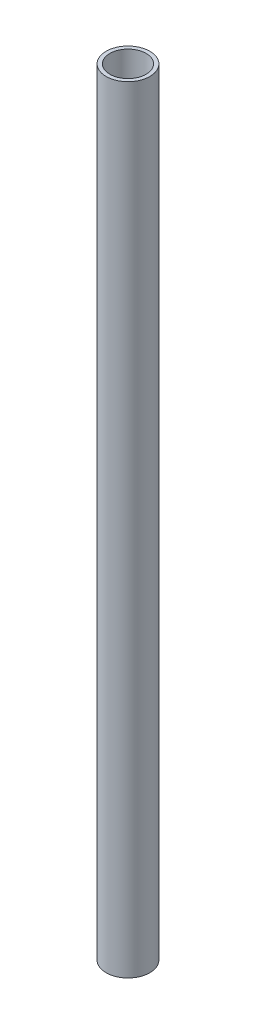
from build123d import *

# Parameters (mm, degrees)
SKETCH1_R      = 10.7315
SKETCH1_R_2    = 8.89
EXTRUDE1_DEPTH = 381


with BuildPart() as part:
    # Sketch1 → Extrude1 (new body)
    with BuildSketch(Plane(origin=(0, 0, 0), x_dir=(1, 0, 0), z_dir=(0, 1, 0))):
        with Locations(Location((0, 0, 0), (0, 0, 270))):
            Circle(SKETCH1_R)
        with Locations(Location((0, 0, 0), (0, 0, 270))):
            Circle(SKETCH1_R_2, mode=Mode.SUBTRACT)
    extrude(amount=-EXTRUDE1_DEPTH)


solid = part.part
